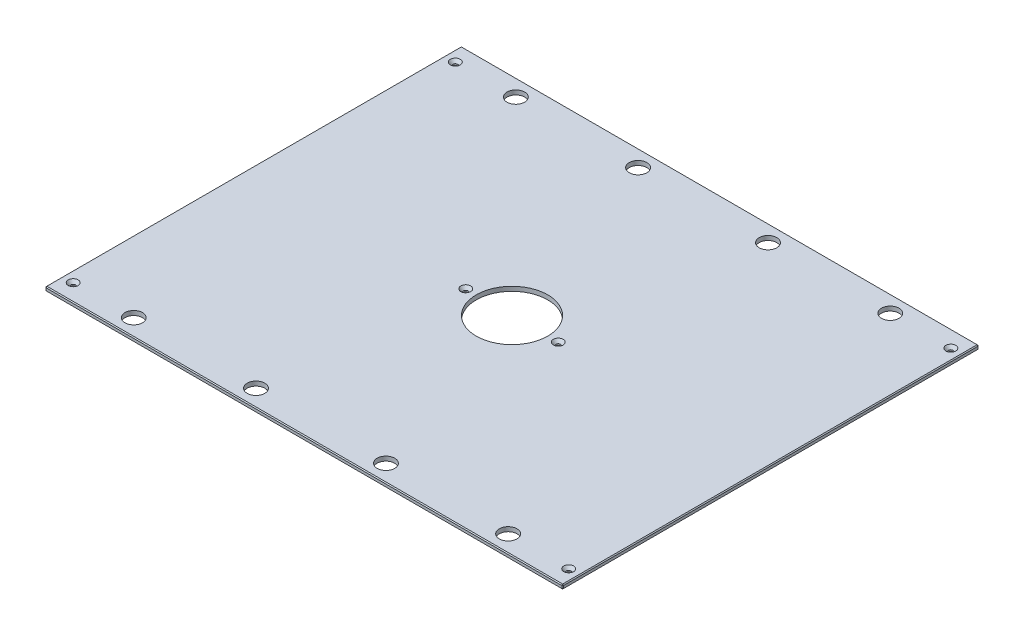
ISO-10303-21;
HEADER;
FILE_DESCRIPTION(('STEP AP214'),'2;1');
FILE_NAME('part.step','',(''),(''),'','','');
FILE_SCHEMA(('AUTOMOTIVE_DESIGN { 1 0 10303 214 1 1 1 1 }'));
ENDSEC;
DATA;
#1=APPLICATION_CONTEXT('core data for automotive mechanical design processes');
#2=APPLICATION_PROTOCOL_DEFINITION('international standard','automotive_design',2000,#1);
#3=PRODUCT_CONTEXT('',#1,'mechanical');
#4=PRODUCT('Part','Part','',(#3));
#5=PRODUCT_RELATED_PRODUCT_CATEGORY('part','',(#4));
#6=PRODUCT_DEFINITION_FORMATION('','',#4);
#7=PRODUCT_DEFINITION_CONTEXT('part definition',#1,'design');
#8=PRODUCT_DEFINITION('design','',#6,#7);
#9=PRODUCT_DEFINITION_SHAPE('','',#8);
#10=(LENGTH_UNIT() NAMED_UNIT(*) SI_UNIT(.MILLI.,.METRE.));
#11=(NAMED_UNIT(*) PLANE_ANGLE_UNIT() SI_UNIT($,.RADIAN.));
#12=(NAMED_UNIT(*) SI_UNIT($,.STERADIAN.) SOLID_ANGLE_UNIT());
#13=UNCERTAINTY_MEASURE_WITH_UNIT(LENGTH_MEASURE(1.E-05),#10,'distance_accuracy_value','');
#14=(GEOMETRIC_REPRESENTATION_CONTEXT(3) GLOBAL_UNCERTAINTY_ASSIGNED_CONTEXT((#13)) GLOBAL_UNIT_ASSIGNED_CONTEXT((#10,
#11,#12)) REPRESENTATION_CONTEXT('',''));
#15=CARTESIAN_POINT('',(0.,0.,0.));
#16=DIRECTION('',(0.,0.,1.));
#17=DIRECTION('',(1.,0.,0.));
#18=AXIS2_PLACEMENT_3D('',#15,#16,#17);
#19=CARTESIAN_POINT('',(-373.0625,6.35,-300.0375));
#20=DIRECTION('',(1.,0.,0.));
#21=DIRECTION('',(0.,0.,-1.));
#22=AXIS2_PLACEMENT_3D('',#19,#20,#21);
#23=PLANE('',#22);
#24=DIRECTION('',(0.,0.,-1.));
#25=VECTOR('',#24,1.);
#26=CARTESIAN_POINT('',(-373.0625,5.08000000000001,-300.0375));
#27=LINE('',#26,#25);
#28=CARTESIAN_POINT('',(-373.0625,5.08000000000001,298.7675));
#29=VERTEX_POINT('',#28);
#30=CARTESIAN_POINT('',(-373.0625,5.08000000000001,-298.7675));
#31=VERTEX_POINT('',#30);
#32=EDGE_CURVE('E135',#29,#31,#27,.T.);
#33=ORIENTED_EDGE('',*,*,#32,.T.);
#34=DIRECTION('',(0.,-1.,0.));
#35=VECTOR('',#34,1.);
#36=CARTESIAN_POINT('',(-373.0625,6.35,-298.7675));
#37=LINE('',#36,#35);
#38=CARTESIAN_POINT('',(-373.0625,1.26999999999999,-298.7675));
#39=VERTEX_POINT('',#38);
#40=EDGE_CURVE('E131',#31,#39,#37,.T.);
#41=ORIENTED_EDGE('',*,*,#40,.T.);
#42=DIRECTION('',(0.,0.,1.));
#43=VECTOR('',#42,1.);
#44=CARTESIAN_POINT('',(-373.0625,1.26999999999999,-300.0375));
#45=LINE('',#44,#43);
#46=CARTESIAN_POINT('',(-373.0625,1.26999999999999,298.7675));
#47=VERTEX_POINT('',#46);
#48=EDGE_CURVE('E126',#39,#47,#45,.T.);
#49=ORIENTED_EDGE('',*,*,#48,.T.);
#50=DIRECTION('',(0.,1.,0.));
#51=VECTOR('',#50,1.);
#52=CARTESIAN_POINT('',(-373.0625,6.35,298.7675));
#53=LINE('',#52,#51);
#54=EDGE_CURVE('E128',#47,#29,#53,.T.);
#55=ORIENTED_EDGE('',*,*,#54,.T.);
#56=EDGE_LOOP('',(#33,#41,#49,#55));
#57=FACE_BOUND('',#56,.T.);
#58=ADVANCED_FACE('F35',(#57),#23,.F.);
#59=CARTESIAN_POINT('',(-373.0625,6.35,300.0375));
#60=DIRECTION('',(0.,0.,-1.));
#61=DIRECTION('',(-1.,0.,0.));
#62=AXIS2_PLACEMENT_3D('',#59,#60,#61);
#63=PLANE('',#62);
#64=DIRECTION('',(1.,0.,0.));
#65=VECTOR('',#64,1.);
#66=CARTESIAN_POINT('',(-373.0625,1.26999999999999,300.0375));
#67=LINE('',#66,#65);
#68=CARTESIAN_POINT('',(-371.7925,1.26999999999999,300.0375));
#69=VERTEX_POINT('',#68);
#70=CARTESIAN_POINT('',(371.7925,1.26999999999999,300.0375));
#71=VERTEX_POINT('',#70);
#72=EDGE_CURVE('E58',#69,#71,#67,.T.);
#73=ORIENTED_EDGE('',*,*,#72,.T.);
#74=DIRECTION('',(0.,1.,0.));
#75=VECTOR('',#74,1.);
#76=CARTESIAN_POINT('',(371.7925,6.35,300.0375));
#77=LINE('',#76,#75);
#78=CARTESIAN_POINT('',(371.7925,5.08000000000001,300.0375));
#79=VERTEX_POINT('',#78);
#80=EDGE_CURVE('E11',#71,#79,#77,.T.);
#81=ORIENTED_EDGE('',*,*,#80,.T.);
#82=DIRECTION('',(-1.,0.,0.));
#83=VECTOR('',#82,1.);
#84=CARTESIAN_POINT('',(-373.0625,5.08000000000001,300.0375));
#85=LINE('',#84,#83);
#86=CARTESIAN_POINT('',(-371.7925,5.08000000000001,300.0375));
#87=VERTEX_POINT('',#86);
#88=EDGE_CURVE('E44',#79,#87,#85,.T.);
#89=ORIENTED_EDGE('',*,*,#88,.T.);
#90=DIRECTION('',(0.,-1.,0.));
#91=VECTOR('',#90,1.);
#92=CARTESIAN_POINT('',(-371.7925,6.35,300.0375));
#93=LINE('',#92,#91);
#94=EDGE_CURVE('E303',#87,#69,#93,.T.);
#95=ORIENTED_EDGE('',*,*,#94,.T.);
#96=EDGE_LOOP('',(#73,#81,#89,#95));
#97=FACE_BOUND('',#96,.T.);
#98=ADVANCED_FACE('F372',(#97),#63,.F.);
#99=CARTESIAN_POINT('',(373.0625,6.35,-300.0375));
#100=DIRECTION('',(-1.,0.,0.));
#101=DIRECTION('',(0.,0.,1.));
#102=AXIS2_PLACEMENT_3D('',#99,#100,#101);
#103=PLANE('',#102);
#104=DIRECTION('',(0.,0.,-1.));
#105=VECTOR('',#104,1.);
#106=CARTESIAN_POINT('',(373.0625,1.26999999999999,-300.0375));
#107=LINE('',#106,#105);
#108=CARTESIAN_POINT('',(373.0625,1.26999999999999,298.7675));
#109=VERTEX_POINT('',#108);
#110=CARTESIAN_POINT('',(373.0625,1.26999999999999,-298.7675));
#111=VERTEX_POINT('',#110);
#112=EDGE_CURVE('E298',#109,#111,#107,.T.);
#113=ORIENTED_EDGE('',*,*,#112,.T.);
#114=DIRECTION('',(0.,1.,0.));
#115=VECTOR('',#114,1.);
#116=CARTESIAN_POINT('',(373.0625,6.35,-298.7675));
#117=LINE('',#116,#115);
#118=CARTESIAN_POINT('',(373.0625,5.08000000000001,-298.7675));
#119=VERTEX_POINT('',#118);
#120=EDGE_CURVE('E300',#111,#119,#117,.T.);
#121=ORIENTED_EDGE('',*,*,#120,.T.);
#122=DIRECTION('',(0.,0.,1.));
#123=VECTOR('',#122,1.);
#124=CARTESIAN_POINT('',(373.0625,5.08000000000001,300.0375));
#125=LINE('',#124,#123);
#126=CARTESIAN_POINT('',(373.0625,5.08000000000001,298.7675));
#127=VERTEX_POINT('',#126);
#128=EDGE_CURVE('E296',#119,#127,#125,.T.);
#129=ORIENTED_EDGE('',*,*,#128,.T.);
#130=DIRECTION('',(0.,-1.,0.));
#131=VECTOR('',#130,1.);
#132=CARTESIAN_POINT('',(373.0625,6.35,298.7675));
#133=LINE('',#132,#131);
#134=EDGE_CURVE('E294',#127,#109,#133,.T.);
#135=ORIENTED_EDGE('',*,*,#134,.T.);
#136=EDGE_LOOP('',(#113,#121,#129,#135));
#137=FACE_BOUND('',#136,.T.);
#138=ADVANCED_FACE('F359',(#137),#103,.F.);
#139=CARTESIAN_POINT('',(-373.0625,6.35,-300.0375));
#140=DIRECTION('',(0.,0.,1.));
#141=DIRECTION('',(1.,0.,0.));
#142=AXIS2_PLACEMENT_3D('',#139,#140,#141);
#143=PLANE('',#142);
#144=DIRECTION('',(-1.,0.,0.));
#145=VECTOR('',#144,1.);
#146=CARTESIAN_POINT('',(-373.0625,1.26999999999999,-300.0375));
#147=LINE('',#146,#145);
#148=CARTESIAN_POINT('',(371.7925,1.26999999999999,-300.0375));
#149=VERTEX_POINT('',#148);
#150=CARTESIAN_POINT('',(-371.7925,1.26999999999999,-300.0375));
#151=VERTEX_POINT('',#150);
#152=EDGE_CURVE('E270',#149,#151,#147,.T.);
#153=ORIENTED_EDGE('',*,*,#152,.T.);
#154=DIRECTION('',(0.,1.,0.));
#155=VECTOR('',#154,1.);
#156=CARTESIAN_POINT('',(-371.7925,6.35,-300.0375));
#157=LINE('',#156,#155);
#158=CARTESIAN_POINT('',(-371.7925,5.08000000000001,-300.0375));
#159=VERTEX_POINT('',#158);
#160=EDGE_CURVE('E274',#151,#159,#157,.T.);
#161=ORIENTED_EDGE('',*,*,#160,.T.);
#162=DIRECTION('',(1.,0.,0.));
#163=VECTOR('',#162,1.);
#164=CARTESIAN_POINT('',(373.0625,5.08000000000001,-300.0375));
#165=LINE('',#164,#163);
#166=CARTESIAN_POINT('',(371.7925,5.08000000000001,-300.0375));
#167=VERTEX_POINT('',#166);
#168=EDGE_CURVE('E272',#159,#167,#165,.T.);
#169=ORIENTED_EDGE('',*,*,#168,.T.);
#170=DIRECTION('',(0.,-1.,0.));
#171=VECTOR('',#170,1.);
#172=CARTESIAN_POINT('',(371.7925,6.35,-300.0375));
#173=LINE('',#172,#171);
#174=EDGE_CURVE('E268',#167,#149,#173,.T.);
#175=ORIENTED_EDGE('',*,*,#174,.T.);
#176=EDGE_LOOP('',(#153,#161,#169,#175));
#177=FACE_BOUND('',#176,.T.);
#178=ADVANCED_FACE('F333',(#177),#143,.F.);
#179=CARTESIAN_POINT('',(0.,6.35,0.));
#180=DIRECTION('',(0.,1.,0.));
#181=DIRECTION('',(0.,0.,1.));
#182=AXIS2_PLACEMENT_3D('',#179,#180,#181);
#183=PLANE('',#182);
#184=CARTESIAN_POINT('',(357.1875,6.35,-275.42998));
#185=DIRECTION('',(0.,1.,0.));
#186=DIRECTION('',(0.,0.,1.));
#187=AXIS2_PLACEMENT_3D('',#184,#185,#186);
#188=CIRCLE('',#187,7.13740000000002);
#189=CARTESIAN_POINT('',(357.1875,6.35,-268.29258));
#190=VERTEX_POINT('',#189);
#191=EDGE_CURVE('E816',#190,#190,#188,.T.);
#192=ORIENTED_EDGE('',*,*,#191,.F.);
#193=EDGE_LOOP('',(#192));
#194=FACE_BOUND('',#193,.T.);
#195=CARTESIAN_POINT('',(357.1875,6.35,275.42998));
#196=DIRECTION('',(0.,1.,0.));
#197=DIRECTION('',(0.,0.,1.));
#198=AXIS2_PLACEMENT_3D('',#195,#196,#197);
#199=CIRCLE('',#198,7.13740000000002);
#200=CARTESIAN_POINT('',(357.1875,6.35,282.56738));
#201=VERTEX_POINT('',#200);
#202=EDGE_CURVE('E820',#201,#201,#199,.T.);
#203=ORIENTED_EDGE('',*,*,#202,.F.);
#204=EDGE_LOOP('',(#203));
#205=FACE_BOUND('',#204,.T.);
#206=CARTESIAN_POINT('',(-357.1875,6.35,275.42998));
#207=DIRECTION('',(0.,1.,0.));
#208=DIRECTION('',(0.,0.,1.));
#209=AXIS2_PLACEMENT_3D('',#206,#207,#208);
#210=CIRCLE('',#209,7.13740000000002);
#211=CARTESIAN_POINT('',(-357.1875,6.35,282.56738));
#212=VERTEX_POINT('',#211);
#213=EDGE_CURVE('E824',#212,#212,#210,.T.);
#214=ORIENTED_EDGE('',*,*,#213,.F.);
#215=EDGE_LOOP('',(#214));
#216=FACE_BOUND('',#215,.T.);
#217=CARTESIAN_POINT('',(-66.675,6.35,0.));
#218=DIRECTION('',(0.,1.,0.));
#219=DIRECTION('',(0.,0.,1.));
#220=AXIS2_PLACEMENT_3D('',#217,#218,#219);
#221=CIRCLE('',#220,7.1374);
#222=CARTESIAN_POINT('',(-66.675,6.35,7.1374));
#223=VERTEX_POINT('',#222);
#224=EDGE_CURVE('E828',#223,#223,#221,.T.);
#225=ORIENTED_EDGE('',*,*,#224,.F.);
#226=EDGE_LOOP('',(#225));
#227=FACE_BOUND('',#226,.T.);
#228=CARTESIAN_POINT('',(66.675,6.35,0.));
#229=DIRECTION('',(0.,1.,0.));
#230=DIRECTION('',(0.,0.,1.));
#231=AXIS2_PLACEMENT_3D('',#228,#229,#230);
#232=CIRCLE('',#231,7.1374);
#233=CARTESIAN_POINT('',(66.675,6.35,7.1374));
#234=VERTEX_POINT('',#233);
#235=EDGE_CURVE('E832',#234,#234,#232,.T.);
#236=ORIENTED_EDGE('',*,*,#235,.F.);
#237=EDGE_LOOP('',(#236));
#238=FACE_BOUND('',#237,.T.);
#239=CARTESIAN_POINT('',(-357.1875,6.35,-275.42998));
#240=DIRECTION('',(0.,1.,0.));
#241=DIRECTION('',(0.,0.,1.));
#242=AXIS2_PLACEMENT_3D('',#239,#240,#241);
#243=CIRCLE('',#242,7.13740000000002);
#244=CARTESIAN_POINT('',(-357.1875,6.35,-268.29258));
#245=VERTEX_POINT('',#244);
#246=EDGE_CURVE('E835',#245,#245,#243,.T.);
#247=ORIENTED_EDGE('',*,*,#246,.F.);
#248=EDGE_LOOP('',(#247));
#249=FACE_BOUND('',#248,.T.);
#250=DIRECTION('',(0.,0.,-1.));
#251=VECTOR('',#250,1.);
#252=CARTESIAN_POINT('',(371.7925,6.35,-300.0375));
#253=LINE('',#252,#251);
#254=CARTESIAN_POINT('',(371.7925,6.35,298.7675));
#255=VERTEX_POINT('',#254);
#256=CARTESIAN_POINT('',(371.7925,6.35,-298.7675));
#257=VERTEX_POINT('',#256);
#258=EDGE_CURVE('E281',#255,#257,#253,.T.);
#259=ORIENTED_EDGE('',*,*,#258,.T.);
#260=DIRECTION('',(-1.,0.,0.));
#261=VECTOR('',#260,1.);
#262=CARTESIAN_POINT('',(-373.0625,6.35,-298.7675));
#263=LINE('',#262,#261);
#264=CARTESIAN_POINT('',(-371.7925,6.35,-298.7675));
#265=VERTEX_POINT('',#264);
#266=EDGE_CURVE('E283',#257,#265,#263,.T.);
#267=ORIENTED_EDGE('',*,*,#266,.T.);
#268=DIRECTION('',(0.,0.,1.));
#269=VECTOR('',#268,1.);
#270=CARTESIAN_POINT('',(-371.7925,6.35,300.0375));
#271=LINE('',#270,#269);
#272=CARTESIAN_POINT('',(-371.7925,6.35,298.7675));
#273=VERTEX_POINT('',#272);
#274=EDGE_CURVE('E279',#265,#273,#271,.T.);
#275=ORIENTED_EDGE('',*,*,#274,.T.);
#276=DIRECTION('',(1.,0.,0.));
#277=VECTOR('',#276,1.);
#278=CARTESIAN_POINT('',(373.0625,6.35,298.7675));
#279=LINE('',#278,#277);
#280=EDGE_CURVE('E277',#273,#255,#279,.T.);
#281=ORIENTED_EDGE('',*,*,#280,.T.);
#282=EDGE_LOOP('',(#259,#267,#275,#281));
#283=FACE_BOUND('',#282,.T.);
#284=CARTESIAN_POINT('',(269.875,6.35,-275.42998));
#285=DIRECTION('',(0.,1.,0.));
#286=DIRECTION('',(0.,0.,1.));
#287=AXIS2_PLACEMENT_3D('',#284,#285,#286);
#288=CIRCLE('',#287,12.7);
#289=CARTESIAN_POINT('',(269.875,6.35,-262.72998));
#290=VERTEX_POINT('',#289);
#291=EDGE_CURVE('E204',#290,#290,#288,.T.);
#292=ORIENTED_EDGE('',*,*,#291,.F.);
#293=EDGE_LOOP('',(#292));
#294=FACE_BOUND('',#293,.T.);
#295=CARTESIAN_POINT('',(-269.875,6.35,-275.42998));
#296=DIRECTION('',(0.,1.,0.));
#297=DIRECTION('',(0.,0.,1.));
#298=AXIS2_PLACEMENT_3D('',#295,#296,#297);
#299=CIRCLE('',#298,12.7);
#300=CARTESIAN_POINT('',(-269.875,6.35,-262.72998));
#301=VERTEX_POINT('',#300);
#302=EDGE_CURVE('E214',#301,#301,#299,.T.);
#303=ORIENTED_EDGE('',*,*,#302,.F.);
#304=EDGE_LOOP('',(#303));
#305=FACE_BOUND('',#304,.T.);
#306=CARTESIAN_POINT('',(269.875,6.35,275.42998));
#307=DIRECTION('',(0.,1.,0.));
#308=DIRECTION('',(0.,0.,1.));
#309=AXIS2_PLACEMENT_3D('',#306,#307,#308);
#310=CIRCLE('',#309,12.7);
#311=CARTESIAN_POINT('',(269.875,6.35,288.12998));
#312=VERTEX_POINT('',#311);
#313=EDGE_CURVE('E225',#312,#312,#310,.T.);
#314=ORIENTED_EDGE('',*,*,#313,.F.);
#315=EDGE_LOOP('',(#314));
#316=FACE_BOUND('',#315,.T.);
#317=CARTESIAN_POINT('',(-269.875,6.35,275.42998));
#318=DIRECTION('',(0.,1.,0.));
#319=DIRECTION('',(0.,0.,1.));
#320=AXIS2_PLACEMENT_3D('',#317,#318,#319);
#321=CIRCLE('',#320,12.7);
#322=CARTESIAN_POINT('',(-269.875,6.35,288.12998));
#323=VERTEX_POINT('',#322);
#324=EDGE_CURVE('E231',#323,#323,#321,.T.);
#325=ORIENTED_EDGE('',*,*,#324,.F.);
#326=EDGE_LOOP('',(#325));
#327=FACE_BOUND('',#326,.T.);
#328=CARTESIAN_POINT('',(-93.6625,6.35,-275.42998));
#329=DIRECTION('',(0.,1.,0.));
#330=DIRECTION('',(0.,0.,1.));
#331=AXIS2_PLACEMENT_3D('',#328,#329,#330);
#332=CIRCLE('',#331,12.7);
#333=CARTESIAN_POINT('',(-93.6625,6.35,-262.72998));
#334=VERTEX_POINT('',#333);
#335=EDGE_CURVE('E237',#334,#334,#332,.T.);
#336=ORIENTED_EDGE('',*,*,#335,.F.);
#337=EDGE_LOOP('',(#336));
#338=FACE_BOUND('',#337,.T.);
#339=CARTESIAN_POINT('',(93.6625,6.35,-275.42998));
#340=DIRECTION('',(0.,1.,0.));
#341=DIRECTION('',(0.,0.,1.));
#342=AXIS2_PLACEMENT_3D('',#339,#340,#341);
#343=CIRCLE('',#342,12.7);
#344=CARTESIAN_POINT('',(93.6625,6.35,-262.72998));
#345=VERTEX_POINT('',#344);
#346=EDGE_CURVE('E243',#345,#345,#343,.T.);
#347=ORIENTED_EDGE('',*,*,#346,.F.);
#348=EDGE_LOOP('',(#347));
#349=FACE_BOUND('',#348,.T.);
#350=CARTESIAN_POINT('',(93.6625,6.35,275.42998));
#351=DIRECTION('',(0.,1.,0.));
#352=DIRECTION('',(0.,0.,1.));
#353=AXIS2_PLACEMENT_3D('',#350,#351,#352);
#354=CIRCLE('',#353,12.7);
#355=CARTESIAN_POINT('',(93.6625,6.35,288.12998));
#356=VERTEX_POINT('',#355);
#357=EDGE_CURVE('E249',#356,#356,#354,.T.);
#358=ORIENTED_EDGE('',*,*,#357,.F.);
#359=EDGE_LOOP('',(#358));
#360=FACE_BOUND('',#359,.T.);
#361=CARTESIAN_POINT('',(-93.6625,6.35,275.42998));
#362=DIRECTION('',(0.,1.,0.));
#363=DIRECTION('',(0.,0.,1.));
#364=AXIS2_PLACEMENT_3D('',#361,#362,#363);
#365=CIRCLE('',#364,12.7);
#366=CARTESIAN_POINT('',(-93.6625,6.35,288.12998));
#367=VERTEX_POINT('',#366);
#368=EDGE_CURVE('E255',#367,#367,#365,.T.);
#369=ORIENTED_EDGE('',*,*,#368,.F.);
#370=EDGE_LOOP('',(#369));
#371=FACE_BOUND('',#370,.T.);
#372=CARTESIAN_POINT('',(0.,6.35,0.));
#373=DIRECTION('',(0.,1.,0.));
#374=DIRECTION('',(0.,0.,1.));
#375=AXIS2_PLACEMENT_3D('',#372,#373,#374);
#376=CIRCLE('',#375,51.562);
#377=CARTESIAN_POINT('',(0.,6.35,51.562));
#378=VERTEX_POINT('',#377);
#379=EDGE_CURVE('E261',#378,#378,#376,.T.);
#380=ORIENTED_EDGE('',*,*,#379,.F.);
#381=EDGE_LOOP('',(#380));
#382=FACE_BOUND('',#381,.T.);
#383=ADVANCED_FACE('F381',(#194,#205,#216,#227,#238,#249,#283,#294,#305,#316,#327,#338,#349,
#360,#371,#382),#183,.T.);
#384=CARTESIAN_POINT('',(0.,0.,0.));
#385=DIRECTION('',(0.,1.,0.));
#386=DIRECTION('',(0.,0.,1.));
#387=AXIS2_PLACEMENT_3D('',#384,#385,#386);
#388=PLANE('',#387);
#389=CARTESIAN_POINT('',(357.1875,0.,-275.42998));
#390=DIRECTION('',(0.,1.,0.));
#391=DIRECTION('',(0.,0.,1.));
#392=AXIS2_PLACEMENT_3D('',#389,#390,#391);
#393=CIRCLE('',#392,3.3782);
#394=CARTESIAN_POINT('',(357.1875,0.,-272.05178));
#395=VERTEX_POINT('',#394);
#396=EDGE_CURVE('E869',#395,#395,#393,.T.);
#397=ORIENTED_EDGE('',*,*,#396,.T.);
#398=EDGE_LOOP('',(#397));
#399=FACE_BOUND('',#398,.T.);
#400=CARTESIAN_POINT('',(357.1875,0.,275.42998));
#401=DIRECTION('',(0.,1.,0.));
#402=DIRECTION('',(0.,0.,1.));
#403=AXIS2_PLACEMENT_3D('',#400,#401,#402);
#404=CIRCLE('',#403,3.3782);
#405=CARTESIAN_POINT('',(357.1875,0.,278.80818));
#406=VERTEX_POINT('',#405);
#407=EDGE_CURVE('E862',#406,#406,#404,.T.);
#408=ORIENTED_EDGE('',*,*,#407,.T.);
#409=EDGE_LOOP('',(#408));
#410=FACE_BOUND('',#409,.T.);
#411=CARTESIAN_POINT('',(-357.1875,0.,275.42998));
#412=DIRECTION('',(0.,1.,0.));
#413=DIRECTION('',(0.,0.,1.));
#414=AXIS2_PLACEMENT_3D('',#411,#412,#413);
#415=CIRCLE('',#414,3.3782);
#416=CARTESIAN_POINT('',(-357.1875,0.,278.80818));
#417=VERTEX_POINT('',#416);
#418=EDGE_CURVE('E855',#417,#417,#415,.T.);
#419=ORIENTED_EDGE('',*,*,#418,.T.);
#420=EDGE_LOOP('',(#419));
#421=FACE_BOUND('',#420,.T.);
#422=CARTESIAN_POINT('',(-66.675,0.,0.));
#423=DIRECTION('',(0.,1.,0.));
#424=DIRECTION('',(0.,0.,1.));
#425=AXIS2_PLACEMENT_3D('',#422,#423,#424);
#426=CIRCLE('',#425,3.3782);
#427=CARTESIAN_POINT('',(-66.675,0.,3.3782));
#428=VERTEX_POINT('',#427);
#429=EDGE_CURVE('E848',#428,#428,#426,.T.);
#430=ORIENTED_EDGE('',*,*,#429,.T.);
#431=EDGE_LOOP('',(#430));
#432=FACE_BOUND('',#431,.T.);
#433=CARTESIAN_POINT('',(66.675,0.,0.));
#434=DIRECTION('',(0.,1.,0.));
#435=DIRECTION('',(0.,0.,1.));
#436=AXIS2_PLACEMENT_3D('',#433,#434,#435);
#437=CIRCLE('',#436,3.3782);
#438=CARTESIAN_POINT('',(66.675,0.,3.3782));
#439=VERTEX_POINT('',#438);
#440=EDGE_CURVE('E838',#439,#439,#437,.T.);
#441=ORIENTED_EDGE('',*,*,#440,.T.);
#442=EDGE_LOOP('',(#441));
#443=FACE_BOUND('',#442,.T.);
#444=CARTESIAN_POINT('',(-357.1875,0.,-275.42998));
#445=DIRECTION('',(0.,1.,0.));
#446=DIRECTION('',(0.,0.,1.));
#447=AXIS2_PLACEMENT_3D('',#444,#445,#446);
#448=CIRCLE('',#447,3.3782);
#449=CARTESIAN_POINT('',(-357.1875,0.,-272.05178));
#450=VERTEX_POINT('',#449);
#451=EDGE_CURVE('E217',#450,#450,#448,.T.);
#452=ORIENTED_EDGE('',*,*,#451,.T.);
#453=EDGE_LOOP('',(#452));
#454=FACE_BOUND('',#453,.T.);
#455=DIRECTION('',(0.,0.,-1.));
#456=VECTOR('',#455,1.);
#457=CARTESIAN_POINT('',(-371.7925,0.,0.));
#458=LINE('',#457,#456);
#459=CARTESIAN_POINT('',(-371.7925,0.,298.7675));
#460=VERTEX_POINT('',#459);
#461=CARTESIAN_POINT('',(-371.7925,0.,-298.7675));
#462=VERTEX_POINT('',#461);
#463=EDGE_CURVE('E158',#460,#462,#458,.T.);
#464=ORIENTED_EDGE('',*,*,#463,.T.);
#465=DIRECTION('',(1.,0.,0.));
#466=VECTOR('',#465,1.);
#467=CARTESIAN_POINT('',(0.,0.,-298.7675));
#468=LINE('',#467,#466);
#469=CARTESIAN_POINT('',(371.7925,0.,-298.7675));
#470=VERTEX_POINT('',#469);
#471=EDGE_CURVE('E291',#462,#470,#468,.T.);
#472=ORIENTED_EDGE('',*,*,#471,.T.);
#473=DIRECTION('',(0.,0.,1.));
#474=VECTOR('',#473,1.);
#475=CARTESIAN_POINT('',(371.7925,0.,0.));
#476=LINE('',#475,#474);
#477=CARTESIAN_POINT('',(371.7925,0.,298.7675));
#478=VERTEX_POINT('',#477);
#479=EDGE_CURVE('E289',#470,#478,#476,.T.);
#480=ORIENTED_EDGE('',*,*,#479,.T.);
#481=DIRECTION('',(-1.,0.,0.));
#482=VECTOR('',#481,1.);
#483=CARTESIAN_POINT('',(0.,0.,298.7675));
#484=LINE('',#483,#482);
#485=EDGE_CURVE('E286',#478,#460,#484,.T.);
#486=ORIENTED_EDGE('',*,*,#485,.T.);
#487=EDGE_LOOP('',(#464,#472,#480,#486));
#488=FACE_BOUND('',#487,.T.);
#489=CARTESIAN_POINT('',(269.875,0.,-275.42998));
#490=DIRECTION('',(0.,1.,0.));
#491=DIRECTION('',(0.,0.,1.));
#492=AXIS2_PLACEMENT_3D('',#489,#490,#491);
#493=CIRCLE('',#492,12.7);
#494=CARTESIAN_POINT('',(269.875,0.,-262.72998));
#495=VERTEX_POINT('',#494);
#496=EDGE_CURVE('E209',#495,#495,#493,.T.);
#497=ORIENTED_EDGE('',*,*,#496,.T.);
#498=EDGE_LOOP('',(#497));
#499=FACE_BOUND('',#498,.T.);
#500=CARTESIAN_POINT('',(-269.875,0.,-275.42998));
#501=DIRECTION('',(0.,1.,0.));
#502=DIRECTION('',(0.,0.,1.));
#503=AXIS2_PLACEMENT_3D('',#500,#501,#502);
#504=CIRCLE('',#503,12.7);
#505=CARTESIAN_POINT('',(-269.875,0.,-262.72998));
#506=VERTEX_POINT('',#505);
#507=EDGE_CURVE('E222',#506,#506,#504,.T.);
#508=ORIENTED_EDGE('',*,*,#507,.T.);
#509=EDGE_LOOP('',(#508));
#510=FACE_BOUND('',#509,.T.);
#511=CARTESIAN_POINT('',(269.875,0.,275.42998));
#512=DIRECTION('',(0.,1.,0.));
#513=DIRECTION('',(0.,0.,1.));
#514=AXIS2_PLACEMENT_3D('',#511,#512,#513);
#515=CIRCLE('',#514,12.7);
#516=CARTESIAN_POINT('',(269.875,0.,288.12998));
#517=VERTEX_POINT('',#516);
#518=EDGE_CURVE('E228',#517,#517,#515,.T.);
#519=ORIENTED_EDGE('',*,*,#518,.T.);
#520=EDGE_LOOP('',(#519));
#521=FACE_BOUND('',#520,.T.);
#522=CARTESIAN_POINT('',(-269.875,0.,275.42998));
#523=DIRECTION('',(0.,1.,0.));
#524=DIRECTION('',(0.,0.,1.));
#525=AXIS2_PLACEMENT_3D('',#522,#523,#524);
#526=CIRCLE('',#525,12.7);
#527=CARTESIAN_POINT('',(-269.875,0.,288.12998));
#528=VERTEX_POINT('',#527);
#529=EDGE_CURVE('E234',#528,#528,#526,.T.);
#530=ORIENTED_EDGE('',*,*,#529,.T.);
#531=EDGE_LOOP('',(#530));
#532=FACE_BOUND('',#531,.T.);
#533=CARTESIAN_POINT('',(-93.6625,0.,-275.42998));
#534=DIRECTION('',(0.,1.,0.));
#535=DIRECTION('',(0.,0.,1.));
#536=AXIS2_PLACEMENT_3D('',#533,#534,#535);
#537=CIRCLE('',#536,12.7);
#538=CARTESIAN_POINT('',(-93.6625,0.,-262.72998));
#539=VERTEX_POINT('',#538);
#540=EDGE_CURVE('E240',#539,#539,#537,.T.);
#541=ORIENTED_EDGE('',*,*,#540,.T.);
#542=EDGE_LOOP('',(#541));
#543=FACE_BOUND('',#542,.T.);
#544=CARTESIAN_POINT('',(93.6625,0.,-275.42998));
#545=DIRECTION('',(0.,1.,0.));
#546=DIRECTION('',(0.,0.,1.));
#547=AXIS2_PLACEMENT_3D('',#544,#545,#546);
#548=CIRCLE('',#547,12.7);
#549=CARTESIAN_POINT('',(93.6625,0.,-262.72998));
#550=VERTEX_POINT('',#549);
#551=EDGE_CURVE('E246',#550,#550,#548,.T.);
#552=ORIENTED_EDGE('',*,*,#551,.T.);
#553=EDGE_LOOP('',(#552));
#554=FACE_BOUND('',#553,.T.);
#555=CARTESIAN_POINT('',(93.6625,0.,275.42998));
#556=DIRECTION('',(0.,1.,0.));
#557=DIRECTION('',(0.,0.,1.));
#558=AXIS2_PLACEMENT_3D('',#555,#556,#557);
#559=CIRCLE('',#558,12.7);
#560=CARTESIAN_POINT('',(93.6625,0.,288.12998));
#561=VERTEX_POINT('',#560);
#562=EDGE_CURVE('E252',#561,#561,#559,.T.);
#563=ORIENTED_EDGE('',*,*,#562,.T.);
#564=EDGE_LOOP('',(#563));
#565=FACE_BOUND('',#564,.T.);
#566=CARTESIAN_POINT('',(-93.6625,0.,275.42998));
#567=DIRECTION('',(0.,1.,0.));
#568=DIRECTION('',(0.,0.,1.));
#569=AXIS2_PLACEMENT_3D('',#566,#567,#568);
#570=CIRCLE('',#569,12.7);
#571=CARTESIAN_POINT('',(-93.6625,0.,288.12998));
#572=VERTEX_POINT('',#571);
#573=EDGE_CURVE('E258',#572,#572,#570,.T.);
#574=ORIENTED_EDGE('',*,*,#573,.T.);
#575=EDGE_LOOP('',(#574));
#576=FACE_BOUND('',#575,.T.);
#577=CARTESIAN_POINT('',(0.,0.,0.));
#578=DIRECTION('',(0.,1.,0.));
#579=DIRECTION('',(0.,0.,1.));
#580=AXIS2_PLACEMENT_3D('',#577,#578,#579);
#581=CIRCLE('',#580,51.562);
#582=CARTESIAN_POINT('',(0.,0.,51.562));
#583=VERTEX_POINT('',#582);
#584=EDGE_CURVE('E147',#583,#583,#581,.T.);
#585=ORIENTED_EDGE('',*,*,#584,.T.);
#586=EDGE_LOOP('',(#585));
#587=FACE_BOUND('',#586,.T.);
#588=ADVANCED_FACE('F346',(#399,#410,#421,#432,#443,#454,#488,#499,#510,#521,#532,#543,#554,
#565,#576,#587),#388,.F.);
#589=CARTESIAN_POINT('',(0.,0.,0.));
#590=DIRECTION('',(0.,1.,0.));
#591=DIRECTION('',(0.,0.,1.));
#592=AXIS2_PLACEMENT_3D('',#589,#590,#591);
#593=CYLINDRICAL_SURFACE('',#592,51.562);
#594=ORIENTED_EDGE('',*,*,#584,.F.);
#595=EDGE_LOOP('',(#594));
#596=FACE_BOUND('',#595,.T.);
#597=ORIENTED_EDGE('',*,*,#379,.T.);
#598=EDGE_LOOP('',(#597));
#599=FACE_BOUND('',#598,.T.);
#600=ADVANCED_FACE('F751',(#596,#599),#593,.F.);
#601=CARTESIAN_POINT('',(-93.6625,6.35,275.42998));
#602=DIRECTION('',(0.,1.,0.));
#603=DIRECTION('',(0.,0.,1.));
#604=AXIS2_PLACEMENT_3D('',#601,#602,#603);
#605=CYLINDRICAL_SURFACE('',#604,12.7);
#606=ORIENTED_EDGE('',*,*,#573,.F.);
#607=EDGE_LOOP('',(#606));
#608=FACE_BOUND('',#607,.T.);
#609=ORIENTED_EDGE('',*,*,#368,.T.);
#610=EDGE_LOOP('',(#609));
#611=FACE_BOUND('',#610,.T.);
#612=ADVANCED_FACE('F742',(#608,#611),#605,.F.);
#613=CARTESIAN_POINT('',(93.6625,6.35,275.42998));
#614=DIRECTION('',(0.,1.,0.));
#615=DIRECTION('',(0.,0.,1.));
#616=AXIS2_PLACEMENT_3D('',#613,#614,#615);
#617=CYLINDRICAL_SURFACE('',#616,12.7);
#618=ORIENTED_EDGE('',*,*,#562,.F.);
#619=EDGE_LOOP('',(#618));
#620=FACE_BOUND('',#619,.T.);
#621=ORIENTED_EDGE('',*,*,#357,.T.);
#622=EDGE_LOOP('',(#621));
#623=FACE_BOUND('',#622,.T.);
#624=ADVANCED_FACE('F733',(#620,#623),#617,.F.);
#625=CARTESIAN_POINT('',(93.6625,6.35,-275.42998));
#626=DIRECTION('',(0.,1.,0.));
#627=DIRECTION('',(0.,0.,1.));
#628=AXIS2_PLACEMENT_3D('',#625,#626,#627);
#629=CYLINDRICAL_SURFACE('',#628,12.7);
#630=ORIENTED_EDGE('',*,*,#551,.F.);
#631=EDGE_LOOP('',(#630));
#632=FACE_BOUND('',#631,.T.);
#633=ORIENTED_EDGE('',*,*,#346,.T.);
#634=EDGE_LOOP('',(#633));
#635=FACE_BOUND('',#634,.T.);
#636=ADVANCED_FACE('F724',(#632,#635),#629,.F.);
#637=CARTESIAN_POINT('',(-93.6625,6.35,-275.42998));
#638=DIRECTION('',(0.,1.,0.));
#639=DIRECTION('',(0.,0.,1.));
#640=AXIS2_PLACEMENT_3D('',#637,#638,#639);
#641=CYLINDRICAL_SURFACE('',#640,12.7);
#642=ORIENTED_EDGE('',*,*,#540,.F.);
#643=EDGE_LOOP('',(#642));
#644=FACE_BOUND('',#643,.T.);
#645=ORIENTED_EDGE('',*,*,#335,.T.);
#646=EDGE_LOOP('',(#645));
#647=FACE_BOUND('',#646,.T.);
#648=ADVANCED_FACE('F715',(#644,#647),#641,.F.);
#649=CARTESIAN_POINT('',(-269.875,6.35,275.42998));
#650=DIRECTION('',(0.,1.,0.));
#651=DIRECTION('',(0.,0.,1.));
#652=AXIS2_PLACEMENT_3D('',#649,#650,#651);
#653=CYLINDRICAL_SURFACE('',#652,12.7);
#654=ORIENTED_EDGE('',*,*,#529,.F.);
#655=EDGE_LOOP('',(#654));
#656=FACE_BOUND('',#655,.T.);
#657=ORIENTED_EDGE('',*,*,#324,.T.);
#658=EDGE_LOOP('',(#657));
#659=FACE_BOUND('',#658,.T.);
#660=ADVANCED_FACE('F706',(#656,#659),#653,.F.);
#661=CARTESIAN_POINT('',(269.875,6.35,275.42998));
#662=DIRECTION('',(0.,1.,0.));
#663=DIRECTION('',(0.,0.,1.));
#664=AXIS2_PLACEMENT_3D('',#661,#662,#663);
#665=CYLINDRICAL_SURFACE('',#664,12.7);
#666=ORIENTED_EDGE('',*,*,#518,.F.);
#667=EDGE_LOOP('',(#666));
#668=FACE_BOUND('',#667,.T.);
#669=ORIENTED_EDGE('',*,*,#313,.T.);
#670=EDGE_LOOP('',(#669));
#671=FACE_BOUND('',#670,.T.);
#672=ADVANCED_FACE('F697',(#668,#671),#665,.F.);
#673=CARTESIAN_POINT('',(-269.875,6.35,-275.42998));
#674=DIRECTION('',(0.,1.,0.));
#675=DIRECTION('',(0.,0.,1.));
#676=AXIS2_PLACEMENT_3D('',#673,#674,#675);
#677=CYLINDRICAL_SURFACE('',#676,12.7);
#678=ORIENTED_EDGE('',*,*,#507,.F.);
#679=EDGE_LOOP('',(#678));
#680=FACE_BOUND('',#679,.T.);
#681=ORIENTED_EDGE('',*,*,#302,.T.);
#682=EDGE_LOOP('',(#681));
#683=FACE_BOUND('',#682,.T.);
#684=ADVANCED_FACE('F687',(#680,#683),#677,.F.);
#685=CARTESIAN_POINT('',(269.875,6.35,-275.42998));
#686=DIRECTION('',(0.,1.,0.));
#687=DIRECTION('',(0.,0.,1.));
#688=AXIS2_PLACEMENT_3D('',#685,#686,#687);
#689=CYLINDRICAL_SURFACE('',#688,12.7);
#690=ORIENTED_EDGE('',*,*,#496,.F.);
#691=EDGE_LOOP('',(#690));
#692=FACE_BOUND('',#691,.T.);
#693=ORIENTED_EDGE('',*,*,#291,.T.);
#694=EDGE_LOOP('',(#693));
#695=FACE_BOUND('',#694,.T.);
#696=ADVANCED_FACE('F390',(#692,#695),#689,.F.);
#697=CARTESIAN_POINT('',(373.0625,6.35,298.7675));
#698=DIRECTION('',(-0.707106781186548,0.,-0.707106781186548));
#699=DIRECTION('',(0.,-1.,0.));
#700=AXIS2_PLACEMENT_3D('',#697,#698,#699);
#701=PLANE('',#700);
#702=DIRECTION('',(-0.707106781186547,0.,0.707106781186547));
#703=VECTOR('',#702,1.);
#704=CARTESIAN_POINT('',(373.0625,5.08000000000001,298.7675));
#705=LINE('',#704,#703);
#706=EDGE_CURVE('E39',#79,#127,#705,.F.);
#707=ORIENTED_EDGE('',*,*,#706,.F.);
#708=ORIENTED_EDGE('',*,*,#80,.F.);
#709=DIRECTION('',(0.707106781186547,0.,-0.707106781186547));
#710=VECTOR('',#709,1.);
#711=CARTESIAN_POINT('',(372.4275,1.26999999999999,299.4025));
#712=LINE('',#711,#710);
#713=EDGE_CURVE('E197',#109,#71,#712,.F.);
#714=ORIENTED_EDGE('',*,*,#713,.F.);
#715=ORIENTED_EDGE('',*,*,#134,.F.);
#716=EDGE_LOOP('',(#707,#708,#714,#715));
#717=FACE_BOUND('',#716,.T.);
#718=ADVANCED_FACE('F37',(#717),#701,.F.);
#719=CARTESIAN_POINT('',(373.0625,5.08000000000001,298.7675));
#720=DIRECTION('',(0.577350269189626,0.577350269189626,0.577350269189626));
#721=DIRECTION('',(0.707106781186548,0.,-0.707106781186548));
#722=AXIS2_PLACEMENT_3D('',#719,#720,#721);
#723=PLANE('',#722);
#724=DIRECTION('',(0.,-0.707106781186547,0.707106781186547));
#725=VECTOR('',#724,1.);
#726=CARTESIAN_POINT('',(371.7925,5.715,299.4025));
#727=LINE('',#726,#725);
#728=EDGE_CURVE('E193',#79,#255,#727,.F.);
#729=ORIENTED_EDGE('',*,*,#728,.F.);
#730=ORIENTED_EDGE('',*,*,#706,.T.);
#731=DIRECTION('',(-0.707106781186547,0.707106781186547,0.));
#732=VECTOR('',#731,1.);
#733=CARTESIAN_POINT('',(373.0625,5.08000000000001,298.7675));
#734=LINE('',#733,#732);
#735=EDGE_CURVE('E195',#255,#127,#734,.F.);
#736=ORIENTED_EDGE('',*,*,#735,.F.);
#737=EDGE_LOOP('',(#729,#730,#736));
#738=FACE_BOUND('',#737,.T.);
#739=ADVANCED_FACE('F383',(#738),#723,.T.);
#740=CARTESIAN_POINT('',(371.7925,0.,298.7675));
#741=DIRECTION('',(0.577350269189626,-0.577350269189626,0.577350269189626));
#742=DIRECTION('',(0.707106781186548,0.,-0.707106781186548));
#743=AXIS2_PLACEMENT_3D('',#740,#741,#742);
#744=PLANE('',#743);
#745=DIRECTION('',(-0.707106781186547,-0.707106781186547,0.));
#746=VECTOR('',#745,1.);
#747=CARTESIAN_POINT('',(371.7925,0.,298.7675));
#748=LINE('',#747,#746);
#749=EDGE_CURVE('E187',#109,#478,#748,.T.);
#750=ORIENTED_EDGE('',*,*,#749,.F.);
#751=ORIENTED_EDGE('',*,*,#713,.T.);
#752=DIRECTION('',(0.,0.707106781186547,0.707106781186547));
#753=VECTOR('',#752,1.);
#754=CARTESIAN_POINT('',(371.7925,0.,298.7675));
#755=LINE('',#754,#753);
#756=EDGE_CURVE('E190',#478,#71,#755,.T.);
#757=ORIENTED_EDGE('',*,*,#756,.F.);
#758=EDGE_LOOP('',(#750,#751,#757));
#759=FACE_BOUND('',#758,.T.);
#760=ADVANCED_FACE('F352',(#759),#744,.T.);
#761=CARTESIAN_POINT('',(371.7925,6.35,0.));
#762=DIRECTION('',(0.707106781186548,0.707106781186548,0.));
#763=DIRECTION('',(0.,0.,1.));
#764=AXIS2_PLACEMENT_3D('',#761,#762,#763);
#765=PLANE('',#764);
#766=ORIENTED_EDGE('',*,*,#735,.T.);
#767=ORIENTED_EDGE('',*,*,#128,.F.);
#768=DIRECTION('',(0.707106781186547,-0.707106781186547,0.));
#769=VECTOR('',#768,1.);
#770=CARTESIAN_POINT('',(372.4275,5.715,-298.7675));
#771=LINE('',#770,#769);
#772=EDGE_CURVE('E182',#257,#119,#771,.T.);
#773=ORIENTED_EDGE('',*,*,#772,.F.);
#774=ORIENTED_EDGE('',*,*,#258,.F.);
#775=EDGE_LOOP('',(#766,#767,#773,#774));
#776=FACE_BOUND('',#775,.T.);
#777=ADVANCED_FACE('F369',(#776),#765,.T.);
#778=CARTESIAN_POINT('',(0.,6.35,298.7675));
#779=DIRECTION('',(0.,0.707106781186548,0.707106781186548));
#780=DIRECTION('',(-1.,0.,0.));
#781=AXIS2_PLACEMENT_3D('',#778,#779,#780);
#782=PLANE('',#781);
#783=ORIENTED_EDGE('',*,*,#728,.T.);
#784=ORIENTED_EDGE('',*,*,#280,.F.);
#785=DIRECTION('',(0.,0.707106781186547,-0.707106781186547));
#786=VECTOR('',#785,1.);
#787=CARTESIAN_POINT('',(-371.7925,6.35,298.7675));
#788=LINE('',#787,#786);
#789=EDGE_CURVE('E179',#87,#273,#788,.T.);
#790=ORIENTED_EDGE('',*,*,#789,.F.);
#791=ORIENTED_EDGE('',*,*,#88,.F.);
#792=EDGE_LOOP('',(#783,#784,#790,#791));
#793=FACE_BOUND('',#792,.T.);
#794=ADVANCED_FACE('F374',(#793),#782,.T.);
#795=CARTESIAN_POINT('',(-371.7925,6.35,300.0375));
#796=DIRECTION('',(0.707106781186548,0.,-0.707106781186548));
#797=DIRECTION('',(0.,-1.,0.));
#798=AXIS2_PLACEMENT_3D('',#795,#796,#797);
#799=PLANE('',#798);
#800=DIRECTION('',(0.707106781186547,0.,0.707106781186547));
#801=VECTOR('',#800,1.);
#802=CARTESIAN_POINT('',(-373.0625,1.26999999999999,298.7675));
#803=LINE('',#802,#801);
#804=EDGE_CURVE('E142',#69,#47,#803,.F.);
#805=ORIENTED_EDGE('',*,*,#804,.F.);
#806=ORIENTED_EDGE('',*,*,#94,.F.);
#807=DIRECTION('',(-0.707106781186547,0.,-0.707106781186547));
#808=VECTOR('',#807,1.);
#809=CARTESIAN_POINT('',(-372.4275,5.08000000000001,299.4025));
#810=LINE('',#809,#808);
#811=EDGE_CURVE('E145',#29,#87,#810,.F.);
#812=ORIENTED_EDGE('',*,*,#811,.F.);
#813=ORIENTED_EDGE('',*,*,#54,.F.);
#814=EDGE_LOOP('',(#805,#806,#812,#813));
#815=FACE_BOUND('',#814,.T.);
#816=ADVANCED_FACE('F140',(#815),#799,.F.);
#817=CARTESIAN_POINT('',(-373.0625,1.26999999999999,300.0375));
#818=DIRECTION('',(0.,0.707106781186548,-0.707106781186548));
#819=DIRECTION('',(1.,0.,0.));
#820=AXIS2_PLACEMENT_3D('',#817,#818,#819);
#821=PLANE('',#820);
#822=ORIENTED_EDGE('',*,*,#756,.T.);
#823=ORIENTED_EDGE('',*,*,#72,.F.);
#824=DIRECTION('',(0.,-0.707106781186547,-0.707106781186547));
#825=VECTOR('',#824,1.);
#826=CARTESIAN_POINT('',(-371.7925,0.634999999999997,299.4025));
#827=LINE('',#826,#825);
#828=EDGE_CURVE('E155',#460,#69,#827,.F.);
#829=ORIENTED_EDGE('',*,*,#828,.F.);
#830=ORIENTED_EDGE('',*,*,#485,.F.);
#831=EDGE_LOOP('',(#822,#823,#829,#830));
#832=FACE_BOUND('',#831,.T.);
#833=ADVANCED_FACE('F351',(#832),#821,.F.);
#834=CARTESIAN_POINT('',(373.0625,1.26999999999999,-300.0375));
#835=DIRECTION('',(-0.707106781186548,0.707106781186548,0.));
#836=DIRECTION('',(0.,0.,-1.));
#837=AXIS2_PLACEMENT_3D('',#834,#835,#836);
#838=PLANE('',#837);
#839=ORIENTED_EDGE('',*,*,#749,.T.);
#840=ORIENTED_EDGE('',*,*,#479,.F.);
#841=DIRECTION('',(0.707106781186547,0.707106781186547,0.));
#842=VECTOR('',#841,1.);
#843=CARTESIAN_POINT('',(371.7925,0.,-298.7675));
#844=LINE('',#843,#842);
#845=EDGE_CURVE('E174',#111,#470,#844,.F.);
#846=ORIENTED_EDGE('',*,*,#845,.F.);
#847=ORIENTED_EDGE('',*,*,#112,.F.);
#848=EDGE_LOOP('',(#839,#840,#846,#847));
#849=FACE_BOUND('',#848,.T.);
#850=ADVANCED_FACE('F356',(#849),#838,.F.);
#851=CARTESIAN_POINT('',(371.7925,6.35,-300.0375));
#852=DIRECTION('',(-0.707106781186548,0.,0.707106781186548));
#853=DIRECTION('',(0.,-1.,0.));
#854=AXIS2_PLACEMENT_3D('',#851,#852,#853);
#855=PLANE('',#854);
#856=DIRECTION('',(0.707106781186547,0.,0.707106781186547));
#857=VECTOR('',#856,1.);
#858=CARTESIAN_POINT('',(371.7925,5.08000000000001,-300.0375));
#859=LINE('',#858,#857);
#860=EDGE_CURVE('E184',#119,#167,#859,.F.);
#861=ORIENTED_EDGE('',*,*,#860,.F.);
#862=ORIENTED_EDGE('',*,*,#120,.F.);
#863=DIRECTION('',(-0.707106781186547,0.,-0.707106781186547));
#864=VECTOR('',#863,1.);
#865=CARTESIAN_POINT('',(372.4275,1.26999999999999,-299.4025));
#866=LINE('',#865,#864);
#867=EDGE_CURVE('E171',#149,#111,#866,.F.);
#868=ORIENTED_EDGE('',*,*,#867,.F.);
#869=ORIENTED_EDGE('',*,*,#174,.F.);
#870=EDGE_LOOP('',(#861,#862,#868,#869));
#871=FACE_BOUND('',#870,.T.);
#872=ADVANCED_FACE('F364',(#871),#855,.F.);
#873=CARTESIAN_POINT('',(371.7925,5.08000000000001,-300.0375));
#874=DIRECTION('',(0.577350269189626,0.577350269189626,-0.577350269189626));
#875=DIRECTION('',(-0.707106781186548,0.,-0.707106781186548));
#876=AXIS2_PLACEMENT_3D('',#873,#874,#875);
#877=PLANE('',#876);
#878=ORIENTED_EDGE('',*,*,#772,.T.);
#879=ORIENTED_EDGE('',*,*,#860,.T.);
#880=DIRECTION('',(0.,0.707106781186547,0.707106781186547));
#881=VECTOR('',#880,1.);
#882=CARTESIAN_POINT('',(371.7925,5.08000000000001,-300.0375));
#883=LINE('',#882,#881);
#884=EDGE_CURVE('E163',#257,#167,#883,.F.);
#885=ORIENTED_EDGE('',*,*,#884,.F.);
#886=EDGE_LOOP('',(#878,#879,#885));
#887=FACE_BOUND('',#886,.T.);
#888=ADVANCED_FACE('F422',(#887),#877,.T.);
#889=CARTESIAN_POINT('',(-371.7925,6.35,298.7675));
#890=DIRECTION('',(-0.577350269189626,0.577350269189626,0.577350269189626));
#891=DIRECTION('',(0.707106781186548,0.,0.707106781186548));
#892=AXIS2_PLACEMENT_3D('',#889,#890,#891);
#893=PLANE('',#892);
#894=ORIENTED_EDGE('',*,*,#811,.T.);
#895=ORIENTED_EDGE('',*,*,#789,.T.);
#896=DIRECTION('',(-0.707106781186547,-0.707106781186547,0.));
#897=VECTOR('',#896,1.);
#898=CARTESIAN_POINT('',(-371.7925,6.35,298.7675));
#899=LINE('',#898,#897);
#900=EDGE_CURVE('E159',#29,#273,#899,.F.);
#901=ORIENTED_EDGE('',*,*,#900,.F.);
#902=EDGE_LOOP('',(#894,#895,#901));
#903=FACE_BOUND('',#902,.T.);
#904=ADVANCED_FACE('F376',(#903),#893,.T.);
#905=CARTESIAN_POINT('',(-373.0625,1.26999999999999,298.7675));
#906=DIRECTION('',(-0.577350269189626,-0.577350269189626,0.577350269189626));
#907=DIRECTION('',(0.707106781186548,0.,0.707106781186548));
#908=AXIS2_PLACEMENT_3D('',#905,#906,#907);
#909=PLANE('',#908);
#910=ORIENTED_EDGE('',*,*,#828,.T.);
#911=ORIENTED_EDGE('',*,*,#804,.T.);
#912=DIRECTION('',(-0.707106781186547,0.707106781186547,0.));
#913=VECTOR('',#912,1.);
#914=CARTESIAN_POINT('',(-373.0625,1.26999999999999,298.7675));
#915=LINE('',#914,#913);
#916=EDGE_CURVE('E152',#460,#47,#915,.T.);
#917=ORIENTED_EDGE('',*,*,#916,.F.);
#918=EDGE_LOOP('',(#910,#911,#917));
#919=FACE_BOUND('',#918,.T.);
#920=ADVANCED_FACE('F151',(#919),#909,.T.);
#921=CARTESIAN_POINT('',(371.7925,0.,-298.7675));
#922=DIRECTION('',(0.577350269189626,-0.577350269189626,-0.577350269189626));
#923=DIRECTION('',(-0.707106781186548,0.,-0.707106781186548));
#924=AXIS2_PLACEMENT_3D('',#921,#922,#923);
#925=PLANE('',#924);
#926=ORIENTED_EDGE('',*,*,#867,.T.);
#927=ORIENTED_EDGE('',*,*,#845,.T.);
#928=DIRECTION('',(0.,-0.707106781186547,0.707106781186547));
#929=VECTOR('',#928,1.);
#930=CARTESIAN_POINT('',(371.7925,0.,-298.7675));
#931=LINE('',#930,#929);
#932=EDGE_CURVE('E160',#149,#470,#931,.T.);
#933=ORIENTED_EDGE('',*,*,#932,.F.);
#934=EDGE_LOOP('',(#926,#927,#933));
#935=FACE_BOUND('',#934,.T.);
#936=ADVANCED_FACE('F414',(#935),#925,.T.);
#937=CARTESIAN_POINT('',(0.,6.35,-298.7675));
#938=DIRECTION('',(0.,0.707106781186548,-0.707106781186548));
#939=DIRECTION('',(1.,0.,0.));
#940=AXIS2_PLACEMENT_3D('',#937,#938,#939);
#941=PLANE('',#940);
#942=ORIENTED_EDGE('',*,*,#884,.T.);
#943=ORIENTED_EDGE('',*,*,#168,.F.);
#944=DIRECTION('',(0.,-0.707106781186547,-0.707106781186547));
#945=VECTOR('',#944,1.);
#946=CARTESIAN_POINT('',(-371.7925,5.08000000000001,-300.0375));
#947=LINE('',#946,#945);
#948=EDGE_CURVE('E165',#265,#159,#947,.T.);
#949=ORIENTED_EDGE('',*,*,#948,.F.);
#950=ORIENTED_EDGE('',*,*,#266,.F.);
#951=EDGE_LOOP('',(#942,#943,#949,#950));
#952=FACE_BOUND('',#951,.T.);
#953=ADVANCED_FACE('F328',(#952),#941,.T.);
#954=CARTESIAN_POINT('',(-371.7925,6.35,0.));
#955=DIRECTION('',(-0.707106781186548,0.707106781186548,0.));
#956=DIRECTION('',(0.,0.,-1.));
#957=AXIS2_PLACEMENT_3D('',#954,#955,#956);
#958=PLANE('',#957);
#959=ORIENTED_EDGE('',*,*,#900,.T.);
#960=ORIENTED_EDGE('',*,*,#274,.F.);
#961=DIRECTION('',(0.707106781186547,0.707106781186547,0.));
#962=VECTOR('',#961,1.);
#963=CARTESIAN_POINT('',(-372.4275,5.715,-298.7675));
#964=LINE('',#963,#962);
#965=EDGE_CURVE('E317',#31,#265,#964,.T.);
#966=ORIENTED_EDGE('',*,*,#965,.F.);
#967=ORIENTED_EDGE('',*,*,#32,.F.);
#968=EDGE_LOOP('',(#959,#960,#966,#967));
#969=FACE_BOUND('',#968,.T.);
#970=ADVANCED_FACE('F379',(#969),#958,.T.);
#971=CARTESIAN_POINT('',(-373.0625,1.26999999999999,-300.0375));
#972=DIRECTION('',(0.707106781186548,0.707106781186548,0.));
#973=DIRECTION('',(0.,0.,1.));
#974=AXIS2_PLACEMENT_3D('',#971,#972,#973);
#975=PLANE('',#974);
#976=ORIENTED_EDGE('',*,*,#916,.T.);
#977=ORIENTED_EDGE('',*,*,#48,.F.);
#978=DIRECTION('',(0.707106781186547,-0.707106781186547,0.));
#979=VECTOR('',#978,1.);
#980=CARTESIAN_POINT('',(-373.0625,1.26999999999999,-298.7675));
#981=LINE('',#980,#979);
#982=EDGE_CURVE('E314',#462,#39,#981,.F.);
#983=ORIENTED_EDGE('',*,*,#982,.F.);
#984=ORIENTED_EDGE('',*,*,#463,.F.);
#985=EDGE_LOOP('',(#976,#977,#983,#984));
#986=FACE_BOUND('',#985,.T.);
#987=ADVANCED_FACE('F157',(#986),#975,.F.);
#988=CARTESIAN_POINT('',(-373.0625,1.26999999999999,-300.0375));
#989=DIRECTION('',(0.,0.707106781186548,0.707106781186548));
#990=DIRECTION('',(-1.,0.,0.));
#991=AXIS2_PLACEMENT_3D('',#988,#989,#990);
#992=PLANE('',#991);
#993=ORIENTED_EDGE('',*,*,#932,.T.);
#994=ORIENTED_EDGE('',*,*,#471,.F.);
#995=DIRECTION('',(0.,0.707106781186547,-0.707106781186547));
#996=VECTOR('',#995,1.);
#997=CARTESIAN_POINT('',(-371.7925,0.634999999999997,-299.4025));
#998=LINE('',#997,#996);
#999=EDGE_CURVE('E311',#151,#462,#998,.F.);
#1000=ORIENTED_EDGE('',*,*,#999,.F.);
#1001=ORIENTED_EDGE('',*,*,#152,.F.);
#1002=EDGE_LOOP('',(#993,#994,#1000,#1001));
#1003=FACE_BOUND('',#1002,.T.);
#1004=ADVANCED_FACE('F343',(#1003),#992,.F.);
#1005=CARTESIAN_POINT('',(-371.7925,5.08000000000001,-300.0375));
#1006=DIRECTION('',(-0.577350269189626,0.577350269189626,-0.577350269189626));
#1007=DIRECTION('',(-0.707106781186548,0.,0.707106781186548));
#1008=AXIS2_PLACEMENT_3D('',#1005,#1006,#1007);
#1009=PLANE('',#1008);
#1010=ORIENTED_EDGE('',*,*,#965,.T.);
#1011=ORIENTED_EDGE('',*,*,#948,.T.);
#1012=DIRECTION('',(0.707106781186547,0.,-0.707106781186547));
#1013=VECTOR('',#1012,1.);
#1014=CARTESIAN_POINT('',(-371.7925,5.08000000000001,-300.0375));
#1015=LINE('',#1014,#1013);
#1016=EDGE_CURVE('E309',#31,#159,#1015,.T.);
#1017=ORIENTED_EDGE('',*,*,#1016,.F.);
#1018=EDGE_LOOP('',(#1010,#1011,#1017));
#1019=FACE_BOUND('',#1018,.T.);
#1020=ADVANCED_FACE('F323',(#1019),#1009,.T.);
#1021=CARTESIAN_POINT('',(-373.0625,1.26999999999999,-298.7675));
#1022=DIRECTION('',(-0.577350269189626,-0.577350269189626,-0.577350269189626));
#1023=DIRECTION('',(-0.707106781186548,0.,0.707106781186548));
#1024=AXIS2_PLACEMENT_3D('',#1021,#1022,#1023);
#1025=PLANE('',#1024);
#1026=ORIENTED_EDGE('',*,*,#999,.T.);
#1027=ORIENTED_EDGE('',*,*,#982,.T.);
#1028=DIRECTION('',(-0.707106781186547,0.,0.707106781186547));
#1029=VECTOR('',#1028,1.);
#1030=CARTESIAN_POINT('',(-373.0625,1.26999999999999,-298.7675));
#1031=LINE('',#1030,#1029);
#1032=EDGE_CURVE('E307',#151,#39,#1031,.T.);
#1033=ORIENTED_EDGE('',*,*,#1032,.F.);
#1034=EDGE_LOOP('',(#1026,#1027,#1033));
#1035=FACE_BOUND('',#1034,.T.);
#1036=ADVANCED_FACE('F340',(#1035),#1025,.T.);
#1037=CARTESIAN_POINT('',(-373.0625,6.35,-298.7675));
#1038=DIRECTION('',(0.707106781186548,0.,0.707106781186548));
#1039=DIRECTION('',(0.,-1.,0.));
#1040=AXIS2_PLACEMENT_3D('',#1037,#1038,#1039);
#1041=PLANE('',#1040);
#1042=ORIENTED_EDGE('',*,*,#1016,.T.);
#1043=ORIENTED_EDGE('',*,*,#160,.F.);
#1044=ORIENTED_EDGE('',*,*,#1032,.T.);
#1045=ORIENTED_EDGE('',*,*,#40,.F.);
#1046=EDGE_LOOP('',(#1042,#1043,#1044,#1045));
#1047=FACE_BOUND('',#1046,.T.);
#1048=ADVANCED_FACE('F338',(#1047),#1041,.F.);
#1049=CARTESIAN_POINT('',(-357.1875,6.35,-275.42998));
#1050=DIRECTION('',(0.,1.,0.));
#1051=DIRECTION('',(0.,0.,1.));
#1052=AXIS2_PLACEMENT_3D('',#1049,#1050,#1051);
#1053=CYLINDRICAL_SURFACE('',#1052,3.3782);
#1054=ORIENTED_EDGE('',*,*,#451,.F.);
#1055=EDGE_LOOP('',(#1054));
#1056=FACE_BOUND('',#1055,.T.);
#1057=CARTESIAN_POINT('',(-357.1875,2.02553508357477,-275.42998));
#1058=DIRECTION('',(0.,1.,0.));
#1059=DIRECTION('',(0.,0.,1.));
#1060=AXIS2_PLACEMENT_3D('',#1057,#1058,#1059);
#1061=CIRCLE('',#1060,3.3782);
#1062=CARTESIAN_POINT('',(-357.1875,2.02553508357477,-272.05178));
#1063=VERTEX_POINT('',#1062);
#1064=EDGE_CURVE('E837',#1063,#1063,#1061,.T.);
#1065=ORIENTED_EDGE('',*,*,#1064,.T.);
#1066=EDGE_LOOP('',(#1065));
#1067=FACE_BOUND('',#1066,.T.);
#1068=ADVANCED_FACE('F401',(#1056,#1067),#1053,.F.);
#1069=CARTESIAN_POINT('',(-357.1875,6.35,-275.42998));
#1070=DIRECTION('',(0.,1.,0.));
#1071=DIRECTION('',(0.,0.,1.));
#1072=AXIS2_PLACEMENT_3D('',#1069,#1070,#1071);
#1073=CONICAL_SURFACE('',#1072,7.13740000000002,0.715584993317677);
#1074=ORIENTED_EDGE('',*,*,#1064,.F.);
#1075=EDGE_LOOP('',(#1074));
#1076=FACE_BOUND('',#1075,.T.);
#1077=ORIENTED_EDGE('',*,*,#246,.T.);
#1078=EDGE_LOOP('',(#1077));
#1079=FACE_BOUND('',#1078,.T.);
#1080=ADVANCED_FACE('F511',(#1076,#1079),#1073,.F.);
#1081=CARTESIAN_POINT('',(66.675,6.35,0.));
#1082=DIRECTION('',(0.,1.,0.));
#1083=DIRECTION('',(0.,0.,1.));
#1084=AXIS2_PLACEMENT_3D('',#1081,#1082,#1083);
#1085=CYLINDRICAL_SURFACE('',#1084,3.3782);
#1086=ORIENTED_EDGE('',*,*,#440,.F.);
#1087=EDGE_LOOP('',(#1086));
#1088=FACE_BOUND('',#1087,.T.);
#1089=CARTESIAN_POINT('',(66.675,2.02553508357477,0.));
#1090=DIRECTION('',(0.,1.,0.));
#1091=DIRECTION('',(0.,0.,1.));
#1092=AXIS2_PLACEMENT_3D('',#1089,#1090,#1091);
#1093=CIRCLE('',#1092,3.3782);
#1094=CARTESIAN_POINT('',(66.675,2.02553508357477,3.3782));
#1095=VERTEX_POINT('',#1094);
#1096=EDGE_CURVE('E842',#1095,#1095,#1093,.T.);
#1097=ORIENTED_EDGE('',*,*,#1096,.T.);
#1098=EDGE_LOOP('',(#1097));
#1099=FACE_BOUND('',#1098,.T.);
#1100=ADVANCED_FACE('F520',(#1088,#1099),#1085,.F.);
#1101=CARTESIAN_POINT('',(66.675,6.35,0.));
#1102=DIRECTION('',(0.,1.,0.));
#1103=DIRECTION('',(0.,0.,1.));
#1104=AXIS2_PLACEMENT_3D('',#1101,#1102,#1103);
#1105=CONICAL_SURFACE('',#1104,7.1374,0.715584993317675);
#1106=ORIENTED_EDGE('',*,*,#1096,.F.);
#1107=EDGE_LOOP('',(#1106));
#1108=FACE_BOUND('',#1107,.T.);
#1109=ORIENTED_EDGE('',*,*,#235,.T.);
#1110=EDGE_LOOP('',(#1109));
#1111=FACE_BOUND('',#1110,.T.);
#1112=ADVANCED_FACE('F528',(#1108,#1111),#1105,.F.);
#1113=CARTESIAN_POINT('',(-66.675,6.35,0.));
#1114=DIRECTION('',(0.,1.,0.));
#1115=DIRECTION('',(0.,0.,1.));
#1116=AXIS2_PLACEMENT_3D('',#1113,#1114,#1115);
#1117=CYLINDRICAL_SURFACE('',#1116,3.3782);
#1118=ORIENTED_EDGE('',*,*,#429,.F.);
#1119=EDGE_LOOP('',(#1118));
#1120=FACE_BOUND('',#1119,.T.);
#1121=CARTESIAN_POINT('',(-66.675,2.02553508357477,0.));
#1122=DIRECTION('',(0.,1.,0.));
#1123=DIRECTION('',(0.,0.,1.));
#1124=AXIS2_PLACEMENT_3D('',#1121,#1122,#1123);
#1125=CIRCLE('',#1124,3.3782);
#1126=CARTESIAN_POINT('',(-66.675,2.02553508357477,3.3782));
#1127=VERTEX_POINT('',#1126);
#1128=EDGE_CURVE('E851',#1127,#1127,#1125,.T.);
#1129=ORIENTED_EDGE('',*,*,#1128,.T.);
#1130=EDGE_LOOP('',(#1129));
#1131=FACE_BOUND('',#1130,.T.);
#1132=ADVANCED_FACE('F536',(#1120,#1131),#1117,.F.);
#1133=CARTESIAN_POINT('',(-66.675,6.35,0.));
#1134=DIRECTION('',(0.,1.,0.));
#1135=DIRECTION('',(0.,0.,1.));
#1136=AXIS2_PLACEMENT_3D('',#1133,#1134,#1135);
#1137=CONICAL_SURFACE('',#1136,7.1374,0.715584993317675);
#1138=ORIENTED_EDGE('',*,*,#1128,.F.);
#1139=EDGE_LOOP('',(#1138));
#1140=FACE_BOUND('',#1139,.T.);
#1141=ORIENTED_EDGE('',*,*,#224,.T.);
#1142=EDGE_LOOP('',(#1141));
#1143=FACE_BOUND('',#1142,.T.);
#1144=ADVANCED_FACE('F544',(#1140,#1143),#1137,.F.);
#1145=CARTESIAN_POINT('',(-357.1875,6.35,275.42998));
#1146=DIRECTION('',(0.,1.,0.));
#1147=DIRECTION('',(0.,0.,1.));
#1148=AXIS2_PLACEMENT_3D('',#1145,#1146,#1147);
#1149=CYLINDRICAL_SURFACE('',#1148,3.3782);
#1150=ORIENTED_EDGE('',*,*,#418,.F.);
#1151=EDGE_LOOP('',(#1150));
#1152=FACE_BOUND('',#1151,.T.);
#1153=CARTESIAN_POINT('',(-357.1875,2.02553508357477,275.42998));
#1154=DIRECTION('',(0.,1.,0.));
#1155=DIRECTION('',(0.,0.,1.));
#1156=AXIS2_PLACEMENT_3D('',#1153,#1154,#1155);
#1157=CIRCLE('',#1156,3.3782);
#1158=CARTESIAN_POINT('',(-357.1875,2.02553508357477,278.80818));
#1159=VERTEX_POINT('',#1158);
#1160=EDGE_CURVE('E858',#1159,#1159,#1157,.T.);
#1161=ORIENTED_EDGE('',*,*,#1160,.T.);
#1162=EDGE_LOOP('',(#1161));
#1163=FACE_BOUND('',#1162,.T.);
#1164=ADVANCED_FACE('F552',(#1152,#1163),#1149,.F.);
#1165=CARTESIAN_POINT('',(-357.1875,6.35,275.42998));
#1166=DIRECTION('',(0.,1.,0.));
#1167=DIRECTION('',(0.,0.,1.));
#1168=AXIS2_PLACEMENT_3D('',#1165,#1166,#1167);
#1169=CONICAL_SURFACE('',#1168,7.13740000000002,0.715584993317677);
#1170=ORIENTED_EDGE('',*,*,#1160,.F.);
#1171=EDGE_LOOP('',(#1170));
#1172=FACE_BOUND('',#1171,.T.);
#1173=ORIENTED_EDGE('',*,*,#213,.T.);
#1174=EDGE_LOOP('',(#1173));
#1175=FACE_BOUND('',#1174,.T.);
#1176=ADVANCED_FACE('F560',(#1172,#1175),#1169,.F.);
#1177=CARTESIAN_POINT('',(357.1875,6.35,275.42998));
#1178=DIRECTION('',(0.,1.,0.));
#1179=DIRECTION('',(0.,0.,1.));
#1180=AXIS2_PLACEMENT_3D('',#1177,#1178,#1179);
#1181=CYLINDRICAL_SURFACE('',#1180,3.3782);
#1182=ORIENTED_EDGE('',*,*,#407,.F.);
#1183=EDGE_LOOP('',(#1182));
#1184=FACE_BOUND('',#1183,.T.);
#1185=CARTESIAN_POINT('',(357.1875,2.02553508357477,275.42998));
#1186=DIRECTION('',(0.,1.,0.));
#1187=DIRECTION('',(0.,0.,1.));
#1188=AXIS2_PLACEMENT_3D('',#1185,#1186,#1187);
#1189=CIRCLE('',#1188,3.3782);
#1190=CARTESIAN_POINT('',(357.1875,2.02553508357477,278.80818));
#1191=VERTEX_POINT('',#1190);
#1192=EDGE_CURVE('E865',#1191,#1191,#1189,.T.);
#1193=ORIENTED_EDGE('',*,*,#1192,.T.);
#1194=EDGE_LOOP('',(#1193));
#1195=FACE_BOUND('',#1194,.T.);
#1196=ADVANCED_FACE('F568',(#1184,#1195),#1181,.F.);
#1197=CARTESIAN_POINT('',(357.1875,6.35,275.42998));
#1198=DIRECTION('',(0.,1.,0.));
#1199=DIRECTION('',(0.,0.,1.));
#1200=AXIS2_PLACEMENT_3D('',#1197,#1198,#1199);
#1201=CONICAL_SURFACE('',#1200,7.13740000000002,0.715584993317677);
#1202=ORIENTED_EDGE('',*,*,#1192,.F.);
#1203=EDGE_LOOP('',(#1202));
#1204=FACE_BOUND('',#1203,.T.);
#1205=ORIENTED_EDGE('',*,*,#202,.T.);
#1206=EDGE_LOOP('',(#1205));
#1207=FACE_BOUND('',#1206,.T.);
#1208=ADVANCED_FACE('F576',(#1204,#1207),#1201,.F.);
#1209=CARTESIAN_POINT('',(357.1875,6.35,-275.42998));
#1210=DIRECTION('',(0.,1.,0.));
#1211=DIRECTION('',(0.,0.,1.));
#1212=AXIS2_PLACEMENT_3D('',#1209,#1210,#1211);
#1213=CYLINDRICAL_SURFACE('',#1212,3.3782);
#1214=ORIENTED_EDGE('',*,*,#396,.F.);
#1215=EDGE_LOOP('',(#1214));
#1216=FACE_BOUND('',#1215,.T.);
#1217=CARTESIAN_POINT('',(357.1875,2.02553508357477,-275.42998));
#1218=DIRECTION('',(0.,1.,0.));
#1219=DIRECTION('',(0.,0.,1.));
#1220=AXIS2_PLACEMENT_3D('',#1217,#1218,#1219);
#1221=CIRCLE('',#1220,3.3782);
#1222=CARTESIAN_POINT('',(357.1875,2.02553508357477,-272.05178));
#1223=VERTEX_POINT('',#1222);
#1224=EDGE_CURVE('E872',#1223,#1223,#1221,.T.);
#1225=ORIENTED_EDGE('',*,*,#1224,.T.);
#1226=EDGE_LOOP('',(#1225));
#1227=FACE_BOUND('',#1226,.T.);
#1228=ADVANCED_FACE('F584',(#1216,#1227),#1213,.F.);
#1229=CARTESIAN_POINT('',(357.1875,6.35,-275.42998));
#1230=DIRECTION('',(0.,1.,0.));
#1231=DIRECTION('',(0.,0.,1.));
#1232=AXIS2_PLACEMENT_3D('',#1229,#1230,#1231);
#1233=CONICAL_SURFACE('',#1232,7.13740000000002,0.715584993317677);
#1234=ORIENTED_EDGE('',*,*,#1224,.F.);
#1235=EDGE_LOOP('',(#1234));
#1236=FACE_BOUND('',#1235,.T.);
#1237=ORIENTED_EDGE('',*,*,#191,.T.);
#1238=EDGE_LOOP('',(#1237));
#1239=FACE_BOUND('',#1238,.T.);
#1240=ADVANCED_FACE('F592',(#1236,#1239),#1233,.F.);
#1241=CLOSED_SHELL('',(#58,#98,#138,#178,#383,#588,#600,#612,#624,#636,#648,#660,#672,#684,#696,
#718,#739,#760,#777,#794,#816,#833,#850,#872,#888,#904,#920,#936,#953,#970,#987,#1004,#1020,
#1036,#1048,#1068,#1080,#1100,#1112,#1132,#1144,#1164,#1176,#1196,#1208,#1228,#1240));
#1242=MANIFOLD_SOLID_BREP('B2',#1241);
#1243=ADVANCED_BREP_SHAPE_REPRESENTATION('',(#18,#1242),#14);
#1244=SHAPE_DEFINITION_REPRESENTATION(#9,#1243);
ENDSEC;
END-ISO-10303-21;
